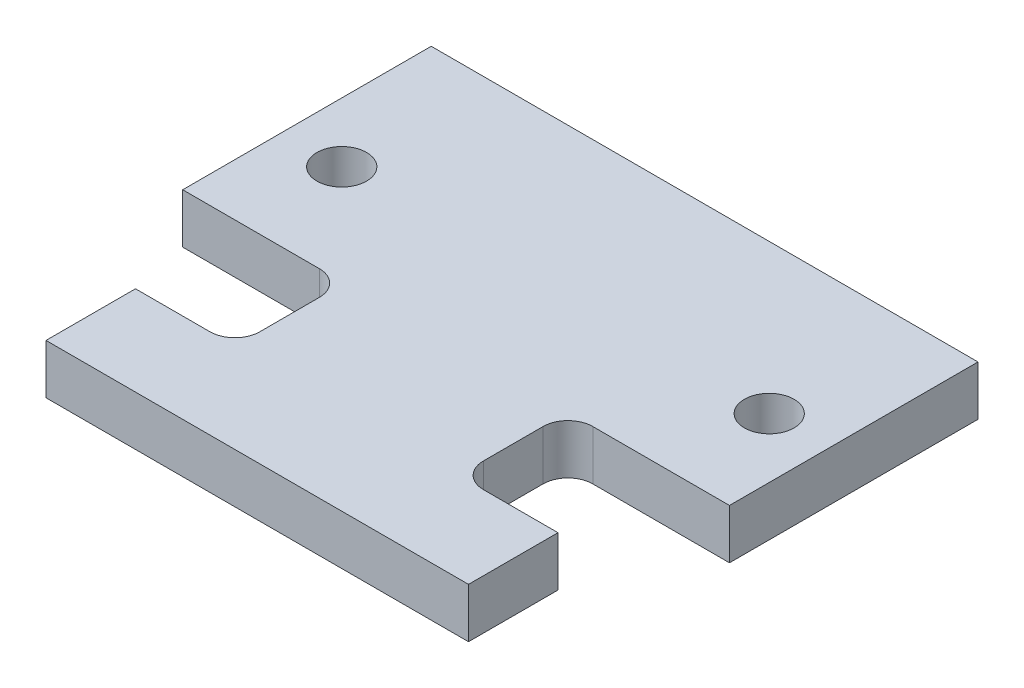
from build123d import *

# Parameters (mm, degrees)
BOSS_EXTRUDE1_DEPTH = 10
SKETCH2_R           = 5
CUT_EXTRUDE1_DEPTH  = 106.948100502
FILLET1_R           = 5


with BuildPart() as part:
    # Sketch1 → Boss-Extrude1 (new body)
    with BuildSketch(Plane(origin=(0, 0, 0), x_dir=(1, 0, 0), z_dir=(0, 1, 0))):
        Polygon((22.5, -50), (55, -50), (55, 0), (-55, 0), (-55, -50), (-22.5, -50), (-22.5, -72), (-42.5, -72), (-42.5, -90), (42.5, -90), (42.5, -72), (22.5, -72), align=None)
    extrude(amount=BOSS_EXTRUDE1_DEPTH)

    # Sketch2 → Cut-Extrude1 (cut, through all)
    with BuildSketch(Plane(origin=(0, 10, 0), x_dir=(1, 0, 0), z_dir=(0, 1, 0))):
        with Locations(Location((43, -30, 0), (0, 0, 270))):
            Circle(SKETCH2_R)
    cut_extrude1 = extrude(amount=-CUT_EXTRUDE1_DEPTH, mode=Mode.SUBTRACT)

    # Mirror1: Cut-Extrude1 across plane
    add(cut_extrude1.mirror(Plane(origin=(0, 0, 0), x_dir=(0, 0, 1), z_dir=(1, 0, 0))), mode=Mode.SUBTRACT)

    # Fillet1
    fillet1_edges = [part.edges().sort_by_distance(p)[0] for p in [
        (22.5, 5, 50),
        (22.5, 5, 72),
        (-22.5, 5, 72),
        (-22.5, 5, 50),
    ]]
    fillet(fillet1_edges, radius=FILLET1_R)


solid = part.part
